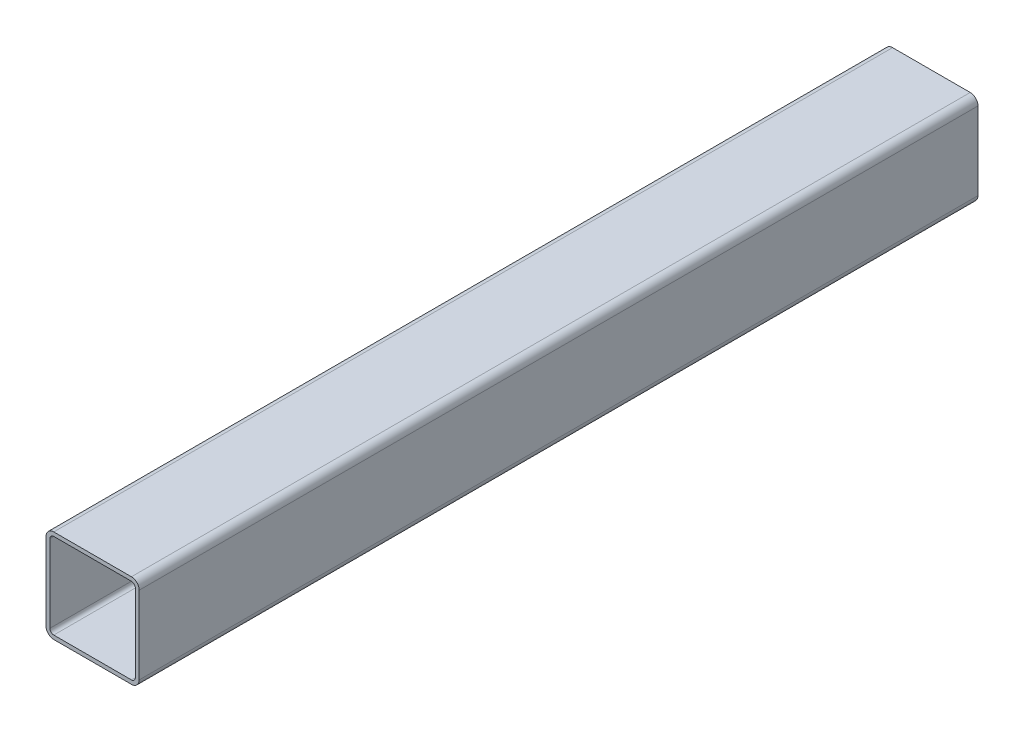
from build123d import *

# Parameters (mm, degrees)
BEAM_6IN_DEPTH      = 152.4
BEAM_6IN_DEPTH_BACK = 1219.2


with BuildPart() as part:
    # 6in beam → Beam 6in (new, two sides: drawn at the far end of the back side and taken through both)
    with BuildSketch(Plane(origin=(0, 0, 0), x_dir=(0, 1, 0), z_dir=(0, 0, 1)).offset(-BEAM_6IN_DEPTH_BACK)):
        with BuildLine():
            Line((-63.5, -76.2), (63.5, -76.2))
            ThreePointArc((63.5, -76.2), (72.480256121, -72.480256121), (76.2, -63.5))
            Line((76.2, -63.5), (76.2, 63.5))
            ThreePointArc((76.2, 63.5), (72.480256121, 72.480256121), (63.5, 76.2))
            Line((63.5, 76.2), (-63.5, 76.2))
            ThreePointArc((-63.5, 76.2), (-72.480256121, 72.480256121), (-76.2, 63.5))
            Line((-76.2, 63.5), (-76.2, -63.5))
            ThreePointArc((-76.2, -63.5), (-72.480256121, -72.480256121), (-63.5, -76.2))
        make_face()
        with BuildLine():
            Line((69.85, 63.5), (69.85, -63.5))
            ThreePointArc((69.85, -63.5), (67.990128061, -67.990128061), (63.5, -69.85))
            Line((63.5, -69.85), (-63.5, -69.85))
            ThreePointArc((-63.5, -69.85), (-67.990128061, -67.990128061), (-69.85, -63.5))
            Line((-69.85, -63.5), (-69.85, 63.5))
            ThreePointArc((-69.85, 63.5), (-67.990128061, 67.990128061), (-63.5, 69.85))
            Line((-63.5, 69.85), (63.5, 69.85))
            ThreePointArc((63.5, 69.85), (67.990128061, 67.990128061), (69.85, 63.5))
        make_face(mode=Mode.SUBTRACT)
    extrude(amount=BEAM_6IN_DEPTH + BEAM_6IN_DEPTH_BACK)


solid = part.part
